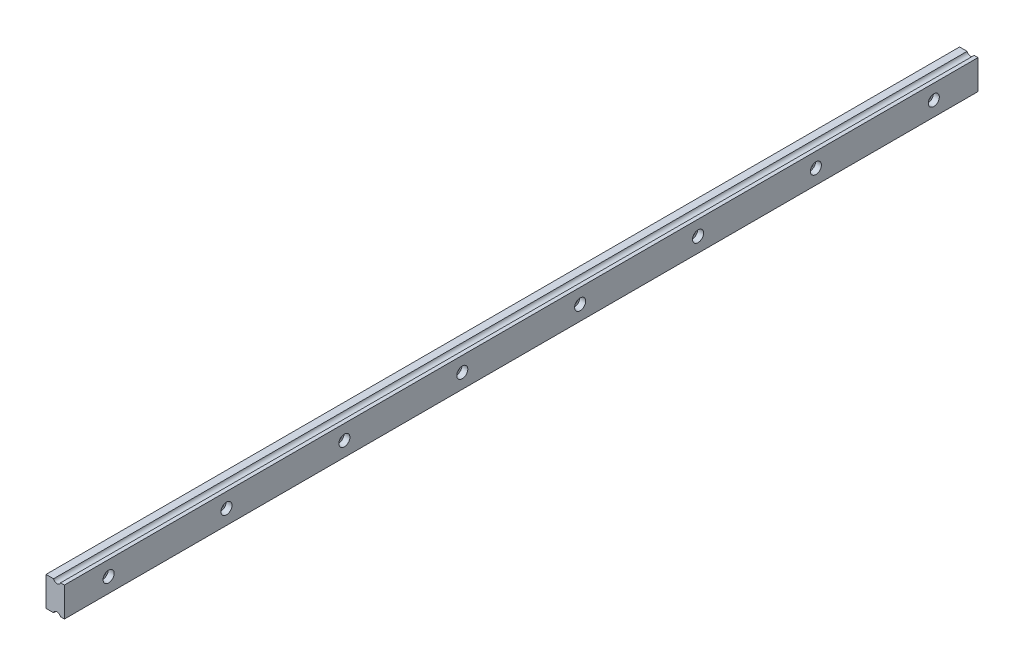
ISO-10303-21;
HEADER;
FILE_DESCRIPTION(('STEP AP214'),'2;1');
FILE_NAME('part.step','',(''),(''),'','','');
FILE_SCHEMA(('AUTOMOTIVE_DESIGN { 1 0 10303 214 1 1 1 1 }'));
ENDSEC;
DATA;
#1=APPLICATION_CONTEXT('core data for automotive mechanical design processes');
#2=APPLICATION_PROTOCOL_DEFINITION('international standard','automotive_design',2000,#1);
#3=PRODUCT_CONTEXT('',#1,'mechanical');
#4=PRODUCT('Part','Part','',(#3));
#5=PRODUCT_RELATED_PRODUCT_CATEGORY('part','',(#4));
#6=PRODUCT_DEFINITION_FORMATION('','',#4);
#7=PRODUCT_DEFINITION_CONTEXT('part definition',#1,'design');
#8=PRODUCT_DEFINITION('design','',#6,#7);
#9=PRODUCT_DEFINITION_SHAPE('','',#8);
#10=(LENGTH_UNIT() NAMED_UNIT(*) SI_UNIT(.MILLI.,.METRE.));
#11=(NAMED_UNIT(*) PLANE_ANGLE_UNIT() SI_UNIT($,.RADIAN.));
#12=(NAMED_UNIT(*) SI_UNIT($,.STERADIAN.) SOLID_ANGLE_UNIT());
#13=UNCERTAINTY_MEASURE_WITH_UNIT(LENGTH_MEASURE(1.E-05),#10,'distance_accuracy_value','');
#14=(GEOMETRIC_REPRESENTATION_CONTEXT(3) GLOBAL_UNCERTAINTY_ASSIGNED_CONTEXT((#13)) GLOBAL_UNIT_ASSIGNED_CONTEXT((#10,
#11,#12)) REPRESENTATION_CONTEXT('',''));
#15=CARTESIAN_POINT('',(0.,0.,0.));
#16=DIRECTION('',(0.,0.,1.));
#17=DIRECTION('',(1.,0.,0.));
#18=AXIS2_PLACEMENT_3D('',#15,#16,#17);
#19=CARTESIAN_POINT('',(-15.,20.,620.));
#20=DIRECTION('',(1.,0.,0.));
#21=DIRECTION('',(0.,0.,-1.));
#22=AXIS2_PLACEMENT_3D('',#19,#20,#21);
#23=PLANE('',#22);
#24=CARTESIAN_POINT('',(-15.,0.,-560.));
#25=DIRECTION('',(1.,0.,0.));
#26=DIRECTION('',(0.,0.,-1.));
#27=AXIS2_PLACEMENT_3D('',#24,#25,#26);
#28=CIRCLE('',#27,4.5);
#29=CARTESIAN_POINT('',(-15.,0.,-564.5));
#30=VERTEX_POINT('',#29);
#31=EDGE_CURVE('E516',#30,#30,#28,.T.);
#32=ORIENTED_EDGE('',*,*,#31,.T.);
#33=EDGE_LOOP('',(#32));
#34=FACE_BOUND('',#33,.T.);
#35=CARTESIAN_POINT('',(-15.,0.,-400.));
#36=DIRECTION('',(1.,0.,0.));
#37=DIRECTION('',(0.,0.,-1.));
#38=AXIS2_PLACEMENT_3D('',#35,#36,#37);
#39=CIRCLE('',#38,4.5);
#40=CARTESIAN_POINT('',(-15.,0.,-404.5));
#41=VERTEX_POINT('',#40);
#42=EDGE_CURVE('E520',#41,#41,#39,.T.);
#43=ORIENTED_EDGE('',*,*,#42,.T.);
#44=EDGE_LOOP('',(#43));
#45=FACE_BOUND('',#44,.T.);
#46=CARTESIAN_POINT('',(-15.,0.,-240.));
#47=DIRECTION('',(1.,0.,0.));
#48=DIRECTION('',(0.,0.,-1.));
#49=AXIS2_PLACEMENT_3D('',#46,#47,#48);
#50=CIRCLE('',#49,4.5);
#51=CARTESIAN_POINT('',(-15.,0.,-244.5));
#52=VERTEX_POINT('',#51);
#53=EDGE_CURVE('E524',#52,#52,#50,.T.);
#54=ORIENTED_EDGE('',*,*,#53,.T.);
#55=EDGE_LOOP('',(#54));
#56=FACE_BOUND('',#55,.T.);
#57=CARTESIAN_POINT('',(-15.,0.,-79.9999999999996));
#58=DIRECTION('',(1.,0.,0.));
#59=DIRECTION('',(0.,0.,-1.));
#60=AXIS2_PLACEMENT_3D('',#57,#58,#59);
#61=CIRCLE('',#60,4.5);
#62=CARTESIAN_POINT('',(-15.,0.,-84.4999999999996));
#63=VERTEX_POINT('',#62);
#64=EDGE_CURVE('E528',#63,#63,#61,.T.);
#65=ORIENTED_EDGE('',*,*,#64,.T.);
#66=EDGE_LOOP('',(#65));
#67=FACE_BOUND('',#66,.T.);
#68=CARTESIAN_POINT('',(-15.,0.,80.0000000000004));
#69=DIRECTION('',(1.,0.,0.));
#70=DIRECTION('',(0.,0.,-1.));
#71=AXIS2_PLACEMENT_3D('',#68,#69,#70);
#72=CIRCLE('',#71,4.5);
#73=CARTESIAN_POINT('',(-15.,0.,75.5000000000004));
#74=VERTEX_POINT('',#73);
#75=EDGE_CURVE('E532',#74,#74,#72,.T.);
#76=ORIENTED_EDGE('',*,*,#75,.T.);
#77=EDGE_LOOP('',(#76));
#78=FACE_BOUND('',#77,.T.);
#79=CARTESIAN_POINT('',(-15.,0.,240.));
#80=DIRECTION('',(1.,0.,0.));
#81=DIRECTION('',(0.,0.,-1.));
#82=AXIS2_PLACEMENT_3D('',#79,#80,#81);
#83=CIRCLE('',#82,4.5);
#84=CARTESIAN_POINT('',(-15.,0.,235.5));
#85=VERTEX_POINT('',#84);
#86=EDGE_CURVE('E536',#85,#85,#83,.T.);
#87=ORIENTED_EDGE('',*,*,#86,.T.);
#88=EDGE_LOOP('',(#87));
#89=FACE_BOUND('',#88,.T.);
#90=CARTESIAN_POINT('',(-15.,0.,400.));
#91=DIRECTION('',(1.,0.,0.));
#92=DIRECTION('',(0.,0.,-1.));
#93=AXIS2_PLACEMENT_3D('',#90,#91,#92);
#94=CIRCLE('',#93,4.5);
#95=CARTESIAN_POINT('',(-15.,0.,395.5));
#96=VERTEX_POINT('',#95);
#97=EDGE_CURVE('E540',#96,#96,#94,.T.);
#98=ORIENTED_EDGE('',*,*,#97,.T.);
#99=EDGE_LOOP('',(#98));
#100=FACE_BOUND('',#99,.T.);
#101=CARTESIAN_POINT('',(-15.,0.,560.));
#102=DIRECTION('',(1.,0.,0.));
#103=DIRECTION('',(0.,0.,-1.));
#104=AXIS2_PLACEMENT_3D('',#101,#102,#103);
#105=CIRCLE('',#104,4.5);
#106=CARTESIAN_POINT('',(-15.,0.,555.5));
#107=VERTEX_POINT('',#106);
#108=EDGE_CURVE('E543',#107,#107,#105,.T.);
#109=ORIENTED_EDGE('',*,*,#108,.T.);
#110=EDGE_LOOP('',(#109));
#111=FACE_BOUND('',#110,.T.);
#112=DIRECTION('',(0.,-1.,0.));
#113=VECTOR('',#112,1.);
#114=CARTESIAN_POINT('',(-15.,20.,-620.));
#115=LINE('',#114,#113);
#116=CARTESIAN_POINT('',(-15.,20.,-620.));
#117=VERTEX_POINT('',#116);
#118=CARTESIAN_POINT('',(-15.,-20.,-620.));
#119=VERTEX_POINT('',#118);
#120=EDGE_CURVE('E416',#117,#119,#115,.T.);
#121=ORIENTED_EDGE('',*,*,#120,.T.);
#122=DIRECTION('',(0.,0.,-1.));
#123=VECTOR('',#122,1.);
#124=CARTESIAN_POINT('',(-15.,-20.,620.));
#125=LINE('',#124,#123);
#126=CARTESIAN_POINT('',(-15.,-20.,620.));
#127=VERTEX_POINT('',#126);
#128=EDGE_CURVE('E11',#127,#119,#125,.T.);
#129=ORIENTED_EDGE('',*,*,#128,.F.);
#130=DIRECTION('',(0.,-1.,0.));
#131=VECTOR('',#130,1.);
#132=CARTESIAN_POINT('',(-15.,20.,620.));
#133=LINE('',#132,#131);
#134=CARTESIAN_POINT('',(-15.,20.,620.));
#135=VERTEX_POINT('',#134);
#136=EDGE_CURVE('E448',#135,#127,#133,.T.);
#137=ORIENTED_EDGE('',*,*,#136,.F.);
#138=DIRECTION('',(0.,0.,-1.));
#139=VECTOR('',#138,1.);
#140=CARTESIAN_POINT('',(-15.,20.,620.));
#141=LINE('',#140,#139);
#142=EDGE_CURVE('E429',#135,#117,#141,.T.);
#143=ORIENTED_EDGE('',*,*,#142,.T.);
#144=EDGE_LOOP('',(#121,#129,#137,#143));
#145=FACE_BOUND('',#144,.T.);
#146=ADVANCED_FACE('F348',(#34,#45,#56,#67,#78,#89,#100,#111,#145),#23,.F.);
#147=CARTESIAN_POINT('',(-15.,-20.,620.));
#148=DIRECTION('',(0.,1.,0.));
#149=DIRECTION('',(-1.,0.,0.));
#150=AXIS2_PLACEMENT_3D('',#147,#148,#149);
#151=PLANE('',#150);
#152=DIRECTION('',(1.,0.,0.));
#153=VECTOR('',#152,1.);
#154=CARTESIAN_POINT('',(-15.,-20.,-620.));
#155=LINE('',#154,#153);
#156=CARTESIAN_POINT('',(-4.76969600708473,-20.,-620.));
#157=VERTEX_POINT('',#156);
#158=EDGE_CURVE('E412',#119,#157,#155,.T.);
#159=ORIENTED_EDGE('',*,*,#158,.T.);
#160=DIRECTION('',(0.,0.,-1.));
#161=VECTOR('',#160,1.);
#162=CARTESIAN_POINT('',(-4.76969600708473,-20.,620.));
#163=LINE('',#162,#161);
#164=CARTESIAN_POINT('',(-4.76969600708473,-20.,620.));
#165=VERTEX_POINT('',#164);
#166=EDGE_CURVE('E355',#165,#157,#163,.T.);
#167=ORIENTED_EDGE('',*,*,#166,.F.);
#168=DIRECTION('',(1.,0.,0.));
#169=VECTOR('',#168,1.);
#170=CARTESIAN_POINT('',(-15.,-20.,620.));
#171=LINE('',#170,#169);
#172=EDGE_CURVE('E425',#127,#165,#171,.T.);
#173=ORIENTED_EDGE('',*,*,#172,.F.);
#174=ORIENTED_EDGE('',*,*,#128,.T.);
#175=EDGE_LOOP('',(#159,#167,#173,#174));
#176=FACE_BOUND('',#175,.T.);
#177=ADVANCED_FACE('F424',(#176),#151,.F.);
#178=CARTESIAN_POINT('',(0.,-21.5000000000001,620.));
#179=DIRECTION('',(0.,0.,-1.));
#180=DIRECTION('',(-1.,0.,0.));
#181=AXIS2_PLACEMENT_3D('',#178,#179,#180);
#182=CYLINDRICAL_SURFACE('',#181,5.);
#183=CARTESIAN_POINT('',(0.,-21.5000000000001,-620.));
#184=DIRECTION('',(0.,0.,-1.));
#185=DIRECTION('',(1.,0.,0.));
#186=AXIS2_PLACEMENT_3D('',#183,#184,#185);
#187=CIRCLE('',#186,5.);
#188=CARTESIAN_POINT('',(4.76969600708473,-20.,-620.));
#189=VERTEX_POINT('',#188);
#190=EDGE_CURVE('E418',#157,#189,#187,.T.);
#191=ORIENTED_EDGE('',*,*,#190,.T.);
#192=DIRECTION('',(0.,0.,-1.));
#193=VECTOR('',#192,1.);
#194=CARTESIAN_POINT('',(4.76969600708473,-20.,620.));
#195=LINE('',#194,#193);
#196=CARTESIAN_POINT('',(4.76969600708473,-20.,620.));
#197=VERTEX_POINT('',#196);
#198=EDGE_CURVE('E474',#197,#189,#195,.T.);
#199=ORIENTED_EDGE('',*,*,#198,.F.);
#200=CARTESIAN_POINT('',(0.,-21.5000000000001,620.));
#201=DIRECTION('',(0.,0.,-1.));
#202=DIRECTION('',(1.,0.,0.));
#203=AXIS2_PLACEMENT_3D('',#200,#201,#202);
#204=CIRCLE('',#203,5.);
#205=EDGE_CURVE('E451',#165,#197,#204,.T.);
#206=ORIENTED_EDGE('',*,*,#205,.F.);
#207=ORIENTED_EDGE('',*,*,#166,.T.);
#208=EDGE_LOOP('',(#191,#199,#206,#207));
#209=FACE_BOUND('',#208,.T.);
#210=ADVANCED_FACE('F478',(#209),#182,.F.);
#211=CARTESIAN_POINT('',(4.76969600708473,-20.,620.));
#212=DIRECTION('',(0.,1.,0.));
#213=DIRECTION('',(0.,0.,1.));
#214=AXIS2_PLACEMENT_3D('',#211,#212,#213);
#215=PLANE('',#214);
#216=DIRECTION('',(1.,0.,0.));
#217=VECTOR('',#216,1.);
#218=CARTESIAN_POINT('',(4.76969600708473,-20.,-620.));
#219=LINE('',#218,#217);
#220=CARTESIAN_POINT('',(10.,-20.,-620.));
#221=VERTEX_POINT('',#220);
#222=EDGE_CURVE('E438',#189,#221,#219,.T.);
#223=ORIENTED_EDGE('',*,*,#222,.T.);
#224=DIRECTION('',(0.,0.,-1.));
#225=VECTOR('',#224,1.);
#226=CARTESIAN_POINT('',(10.,-20.,620.));
#227=LINE('',#226,#225);
#228=CARTESIAN_POINT('',(10.,-20.,620.));
#229=VERTEX_POINT('',#228);
#230=EDGE_CURVE('E471',#229,#221,#227,.T.);
#231=ORIENTED_EDGE('',*,*,#230,.F.);
#232=DIRECTION('',(1.,0.,0.));
#233=VECTOR('',#232,1.);
#234=CARTESIAN_POINT('',(4.76969600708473,-20.,620.));
#235=LINE('',#234,#233);
#236=EDGE_CURVE('E453',#197,#229,#235,.T.);
#237=ORIENTED_EDGE('',*,*,#236,.F.);
#238=ORIENTED_EDGE('',*,*,#198,.T.);
#239=EDGE_LOOP('',(#223,#231,#237,#238));
#240=FACE_BOUND('',#239,.T.);
#241=ADVANCED_FACE('F486',(#240),#215,.F.);
#242=CARTESIAN_POINT('',(10.,20.,620.));
#243=DIRECTION('',(-1.,0.,0.));
#244=DIRECTION('',(0.,0.,1.));
#245=AXIS2_PLACEMENT_3D('',#242,#243,#244);
#246=PLANE('',#245);
#247=CARTESIAN_POINT('',(10.,0.,-560.));
#248=DIRECTION('',(1.,0.,0.));
#249=DIRECTION('',(0.,0.,-1.));
#250=AXIS2_PLACEMENT_3D('',#247,#248,#249);
#251=CIRCLE('',#250,7.5);
#252=CARTESIAN_POINT('',(10.,0.,-567.5));
#253=VERTEX_POINT('',#252);
#254=EDGE_CURVE('E585',#253,#253,#251,.T.);
#255=ORIENTED_EDGE('',*,*,#254,.F.);
#256=EDGE_LOOP('',(#255));
#257=FACE_BOUND('',#256,.T.);
#258=CARTESIAN_POINT('',(10.,0.,-400.));
#259=DIRECTION('',(1.,0.,0.));
#260=DIRECTION('',(0.,0.,-1.));
#261=AXIS2_PLACEMENT_3D('',#258,#259,#260);
#262=CIRCLE('',#261,7.5);
#263=CARTESIAN_POINT('',(10.,0.,-407.5));
#264=VERTEX_POINT('',#263);
#265=EDGE_CURVE('E589',#264,#264,#262,.T.);
#266=ORIENTED_EDGE('',*,*,#265,.F.);
#267=EDGE_LOOP('',(#266));
#268=FACE_BOUND('',#267,.T.);
#269=CARTESIAN_POINT('',(10.,0.,-240.));
#270=DIRECTION('',(1.,0.,0.));
#271=DIRECTION('',(0.,0.,-1.));
#272=AXIS2_PLACEMENT_3D('',#269,#270,#271);
#273=CIRCLE('',#272,7.5);
#274=CARTESIAN_POINT('',(10.,0.,-247.5));
#275=VERTEX_POINT('',#274);
#276=EDGE_CURVE('E593',#275,#275,#273,.T.);
#277=ORIENTED_EDGE('',*,*,#276,.F.);
#278=EDGE_LOOP('',(#277));
#279=FACE_BOUND('',#278,.T.);
#280=CARTESIAN_POINT('',(10.,0.,-79.9999999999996));
#281=DIRECTION('',(1.,0.,0.));
#282=DIRECTION('',(0.,0.,-1.));
#283=AXIS2_PLACEMENT_3D('',#280,#281,#282);
#284=CIRCLE('',#283,7.5);
#285=CARTESIAN_POINT('',(10.,0.,-87.4999999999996));
#286=VERTEX_POINT('',#285);
#287=EDGE_CURVE('E597',#286,#286,#284,.T.);
#288=ORIENTED_EDGE('',*,*,#287,.F.);
#289=EDGE_LOOP('',(#288));
#290=FACE_BOUND('',#289,.T.);
#291=CARTESIAN_POINT('',(10.,0.,80.0000000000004));
#292=DIRECTION('',(1.,0.,0.));
#293=DIRECTION('',(0.,0.,-1.));
#294=AXIS2_PLACEMENT_3D('',#291,#292,#293);
#295=CIRCLE('',#294,7.5);
#296=CARTESIAN_POINT('',(10.,0.,72.5000000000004));
#297=VERTEX_POINT('',#296);
#298=EDGE_CURVE('E601',#297,#297,#295,.T.);
#299=ORIENTED_EDGE('',*,*,#298,.F.);
#300=EDGE_LOOP('',(#299));
#301=FACE_BOUND('',#300,.T.);
#302=CARTESIAN_POINT('',(10.,0.,240.));
#303=DIRECTION('',(1.,0.,0.));
#304=DIRECTION('',(0.,0.,-1.));
#305=AXIS2_PLACEMENT_3D('',#302,#303,#304);
#306=CIRCLE('',#305,7.5);
#307=CARTESIAN_POINT('',(10.,0.,232.5));
#308=VERTEX_POINT('',#307);
#309=EDGE_CURVE('E605',#308,#308,#306,.T.);
#310=ORIENTED_EDGE('',*,*,#309,.F.);
#311=EDGE_LOOP('',(#310));
#312=FACE_BOUND('',#311,.T.);
#313=CARTESIAN_POINT('',(10.,0.,400.));
#314=DIRECTION('',(1.,0.,0.));
#315=DIRECTION('',(0.,0.,-1.));
#316=AXIS2_PLACEMENT_3D('',#313,#314,#315);
#317=CIRCLE('',#316,7.5);
#318=CARTESIAN_POINT('',(10.,0.,392.5));
#319=VERTEX_POINT('',#318);
#320=EDGE_CURVE('E546',#319,#319,#317,.T.);
#321=ORIENTED_EDGE('',*,*,#320,.F.);
#322=EDGE_LOOP('',(#321));
#323=FACE_BOUND('',#322,.T.);
#324=CARTESIAN_POINT('',(10.,0.,560.));
#325=DIRECTION('',(1.,0.,0.));
#326=DIRECTION('',(0.,0.,-1.));
#327=AXIS2_PLACEMENT_3D('',#324,#325,#326);
#328=CIRCLE('',#327,7.5);
#329=CARTESIAN_POINT('',(10.,0.,552.5));
#330=VERTEX_POINT('',#329);
#331=EDGE_CURVE('E430',#330,#330,#328,.T.);
#332=ORIENTED_EDGE('',*,*,#331,.F.);
#333=EDGE_LOOP('',(#332));
#334=FACE_BOUND('',#333,.T.);
#335=DIRECTION('',(0.,1.,0.));
#336=VECTOR('',#335,1.);
#337=CARTESIAN_POINT('',(10.,20.,-620.));
#338=LINE('',#337,#336);
#339=CARTESIAN_POINT('',(10.,20.,-620.));
#340=VERTEX_POINT('',#339);
#341=EDGE_CURVE('E440',#221,#340,#338,.T.);
#342=ORIENTED_EDGE('',*,*,#341,.T.);
#343=DIRECTION('',(0.,0.,-1.));
#344=VECTOR('',#343,1.);
#345=CARTESIAN_POINT('',(10.,20.,620.));
#346=LINE('',#345,#344);
#347=CARTESIAN_POINT('',(10.,20.,620.));
#348=VERTEX_POINT('',#347);
#349=EDGE_CURVE('E468',#348,#340,#346,.T.);
#350=ORIENTED_EDGE('',*,*,#349,.F.);
#351=DIRECTION('',(0.,1.,0.));
#352=VECTOR('',#351,1.);
#353=CARTESIAN_POINT('',(10.,20.,620.));
#354=LINE('',#353,#352);
#355=EDGE_CURVE('E455',#229,#348,#354,.T.);
#356=ORIENTED_EDGE('',*,*,#355,.F.);
#357=ORIENTED_EDGE('',*,*,#230,.T.);
#358=EDGE_LOOP('',(#342,#350,#356,#357));
#359=FACE_BOUND('',#358,.T.);
#360=ADVANCED_FACE('F489',(#257,#268,#279,#290,#301,#312,#323,#334,#359),#246,.F.);
#361=CARTESIAN_POINT('',(4.76969600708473,20.,620.));
#362=DIRECTION('',(0.,-1.,0.));
#363=DIRECTION('',(0.,0.,-1.));
#364=AXIS2_PLACEMENT_3D('',#361,#362,#363);
#365=PLANE('',#364);
#366=DIRECTION('',(-1.,0.,0.));
#367=VECTOR('',#366,1.);
#368=CARTESIAN_POINT('',(4.76969600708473,20.,-620.));
#369=LINE('',#368,#367);
#370=CARTESIAN_POINT('',(4.76969600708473,20.,-620.));
#371=VERTEX_POINT('',#370);
#372=EDGE_CURVE('E442',#340,#371,#369,.T.);
#373=ORIENTED_EDGE('',*,*,#372,.T.);
#374=DIRECTION('',(0.,0.,-1.));
#375=VECTOR('',#374,1.);
#376=CARTESIAN_POINT('',(4.76969600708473,20.,620.));
#377=LINE('',#376,#375);
#378=CARTESIAN_POINT('',(4.76969600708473,20.,620.));
#379=VERTEX_POINT('',#378);
#380=EDGE_CURVE('E465',#379,#371,#377,.T.);
#381=ORIENTED_EDGE('',*,*,#380,.F.);
#382=DIRECTION('',(-1.,0.,0.));
#383=VECTOR('',#382,1.);
#384=CARTESIAN_POINT('',(4.76969600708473,20.,620.));
#385=LINE('',#384,#383);
#386=EDGE_CURVE('E457',#348,#379,#385,.T.);
#387=ORIENTED_EDGE('',*,*,#386,.F.);
#388=ORIENTED_EDGE('',*,*,#349,.T.);
#389=EDGE_LOOP('',(#373,#381,#387,#388));
#390=FACE_BOUND('',#389,.T.);
#391=ADVANCED_FACE('F494',(#390),#365,.F.);
#392=CARTESIAN_POINT('',(0.,21.5000000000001,620.));
#393=DIRECTION('',(0.,0.,-1.));
#394=DIRECTION('',(-1.,0.,0.));
#395=AXIS2_PLACEMENT_3D('',#392,#393,#394);
#396=CYLINDRICAL_SURFACE('',#395,5.);
#397=CARTESIAN_POINT('',(0.,21.5000000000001,-620.));
#398=DIRECTION('',(0.,0.,-1.));
#399=DIRECTION('',(1.,0.,0.));
#400=AXIS2_PLACEMENT_3D('',#397,#398,#399);
#401=CIRCLE('',#400,5.);
#402=CARTESIAN_POINT('',(-4.76969600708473,20.,-620.));
#403=VERTEX_POINT('',#402);
#404=EDGE_CURVE('E444',#371,#403,#401,.T.);
#405=ORIENTED_EDGE('',*,*,#404,.T.);
#406=DIRECTION('',(0.,0.,-1.));
#407=VECTOR('',#406,1.);
#408=CARTESIAN_POINT('',(-4.76969600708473,20.,620.));
#409=LINE('',#408,#407);
#410=CARTESIAN_POINT('',(-4.76969600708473,20.,620.));
#411=VERTEX_POINT('',#410);
#412=EDGE_CURVE('E462',#411,#403,#409,.T.);
#413=ORIENTED_EDGE('',*,*,#412,.F.);
#414=CARTESIAN_POINT('',(0.,21.5000000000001,620.));
#415=DIRECTION('',(0.,0.,-1.));
#416=DIRECTION('',(1.,0.,0.));
#417=AXIS2_PLACEMENT_3D('',#414,#415,#416);
#418=CIRCLE('',#417,5.);
#419=EDGE_CURVE('E367',#379,#411,#418,.T.);
#420=ORIENTED_EDGE('',*,*,#419,.F.);
#421=ORIENTED_EDGE('',*,*,#380,.T.);
#422=EDGE_LOOP('',(#405,#413,#420,#421));
#423=FACE_BOUND('',#422,.T.);
#424=ADVANCED_FACE('F497',(#423),#396,.F.);
#425=CARTESIAN_POINT('',(-15.,20.,620.));
#426=DIRECTION('',(0.,-1.,0.));
#427=DIRECTION('',(1.,0.,0.));
#428=AXIS2_PLACEMENT_3D('',#425,#426,#427);
#429=PLANE('',#428);
#430=DIRECTION('',(-1.,0.,0.));
#431=VECTOR('',#430,1.);
#432=CARTESIAN_POINT('',(-15.,20.,-620.));
#433=LINE('',#432,#431);
#434=EDGE_CURVE('E446',#403,#117,#433,.T.);
#435=ORIENTED_EDGE('',*,*,#434,.T.);
#436=ORIENTED_EDGE('',*,*,#142,.F.);
#437=DIRECTION('',(-1.,0.,0.));
#438=VECTOR('',#437,1.);
#439=CARTESIAN_POINT('',(-15.,20.,620.));
#440=LINE('',#439,#438);
#441=EDGE_CURVE('E362',#411,#135,#440,.T.);
#442=ORIENTED_EDGE('',*,*,#441,.F.);
#443=ORIENTED_EDGE('',*,*,#412,.T.);
#444=EDGE_LOOP('',(#435,#436,#442,#443));
#445=FACE_BOUND('',#444,.T.);
#446=ADVANCED_FACE('F499',(#445),#429,.F.);
#447=CARTESIAN_POINT('',(0.,-21.5000000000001,620.));
#448=DIRECTION('',(0.,0.,1.));
#449=DIRECTION('',(1.,0.,0.));
#450=AXIS2_PLACEMENT_3D('',#447,#448,#449);
#451=PLANE('',#450);
#452=ORIENTED_EDGE('',*,*,#136,.T.);
#453=ORIENTED_EDGE('',*,*,#172,.T.);
#454=ORIENTED_EDGE('',*,*,#205,.T.);
#455=ORIENTED_EDGE('',*,*,#236,.T.);
#456=ORIENTED_EDGE('',*,*,#355,.T.);
#457=ORIENTED_EDGE('',*,*,#386,.T.);
#458=ORIENTED_EDGE('',*,*,#419,.T.);
#459=ORIENTED_EDGE('',*,*,#441,.T.);
#460=EDGE_LOOP('',(#452,#453,#454,#455,#456,#457,#458,#459));
#461=FACE_BOUND('',#460,.T.);
#462=ADVANCED_FACE('F481',(#461),#451,.T.);
#463=CARTESIAN_POINT('',(0.,-21.5000000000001,-620.));
#464=DIRECTION('',(0.,0.,1.));
#465=DIRECTION('',(1.,0.,0.));
#466=AXIS2_PLACEMENT_3D('',#463,#464,#465);
#467=PLANE('',#466);
#468=ORIENTED_EDGE('',*,*,#120,.F.);
#469=ORIENTED_EDGE('',*,*,#434,.F.);
#470=ORIENTED_EDGE('',*,*,#404,.F.);
#471=ORIENTED_EDGE('',*,*,#372,.F.);
#472=ORIENTED_EDGE('',*,*,#341,.F.);
#473=ORIENTED_EDGE('',*,*,#222,.F.);
#474=ORIENTED_EDGE('',*,*,#190,.F.);
#475=ORIENTED_EDGE('',*,*,#158,.F.);
#476=EDGE_LOOP('',(#468,#469,#470,#471,#472,#473,#474,#475));
#477=FACE_BOUND('',#476,.T.);
#478=ADVANCED_FACE('F413',(#477),#467,.F.);
#479=CARTESIAN_POINT('',(10.,0.,560.));
#480=DIRECTION('',(1.,0.,0.));
#481=DIRECTION('',(0.,0.,-1.));
#482=AXIS2_PLACEMENT_3D('',#479,#480,#481);
#483=CYLINDRICAL_SURFACE('',#482,7.5);
#484=CARTESIAN_POINT('',(2.,0.,560.));
#485=DIRECTION('',(1.,0.,0.));
#486=DIRECTION('',(0.,0.,-1.));
#487=AXIS2_PLACEMENT_3D('',#484,#485,#486);
#488=CIRCLE('',#487,7.5);
#489=CARTESIAN_POINT('',(2.,0.,552.5));
#490=VERTEX_POINT('',#489);
#491=EDGE_CURVE('E433',#490,#490,#488,.T.);
#492=ORIENTED_EDGE('',*,*,#491,.F.);
#493=EDGE_LOOP('',(#492));
#494=FACE_BOUND('',#493,.T.);
#495=ORIENTED_EDGE('',*,*,#331,.T.);
#496=EDGE_LOOP('',(#495));
#497=FACE_BOUND('',#496,.T.);
#498=ADVANCED_FACE('F559',(#494,#497),#483,.F.);
#499=CARTESIAN_POINT('',(2.,4.49999999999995,560.));
#500=DIRECTION('',(-1.,0.,0.));
#501=DIRECTION('',(0.,0.,1.));
#502=AXIS2_PLACEMENT_3D('',#499,#500,#501);
#503=PLANE('',#502);
#504=CARTESIAN_POINT('',(2.,0.,560.));
#505=DIRECTION('',(1.,0.,0.));
#506=DIRECTION('',(0.,0.,-1.));
#507=AXIS2_PLACEMENT_3D('',#504,#505,#506);
#508=CIRCLE('',#507,4.50000000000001);
#509=CARTESIAN_POINT('',(2.,0.,555.5));
#510=VERTEX_POINT('',#509);
#511=EDGE_CURVE('E545',#510,#510,#508,.T.);
#512=ORIENTED_EDGE('',*,*,#511,.F.);
#513=EDGE_LOOP('',(#512));
#514=FACE_BOUND('',#513,.T.);
#515=ORIENTED_EDGE('',*,*,#491,.T.);
#516=EDGE_LOOP('',(#515));
#517=FACE_BOUND('',#516,.T.);
#518=ADVANCED_FACE('F557',(#514,#517),#503,.F.);
#519=CARTESIAN_POINT('',(10.,0.,560.));
#520=DIRECTION('',(1.,0.,0.));
#521=DIRECTION('',(0.,0.,-1.));
#522=AXIS2_PLACEMENT_3D('',#519,#520,#521);
#523=CYLINDRICAL_SURFACE('',#522,4.5);
#524=ORIENTED_EDGE('',*,*,#108,.F.);
#525=EDGE_LOOP('',(#524));
#526=FACE_BOUND('',#525,.T.);
#527=ORIENTED_EDGE('',*,*,#511,.T.);
#528=EDGE_LOOP('',(#527));
#529=FACE_BOUND('',#528,.T.);
#530=ADVANCED_FACE('F611',(#526,#529),#523,.F.);
#531=CARTESIAN_POINT('',(10.,0.,400.));
#532=DIRECTION('',(1.,0.,0.));
#533=DIRECTION('',(0.,0.,-1.));
#534=AXIS2_PLACEMENT_3D('',#531,#532,#533);
#535=CYLINDRICAL_SURFACE('',#534,7.5);
#536=CARTESIAN_POINT('',(2.,0.,400.));
#537=DIRECTION('',(1.,0.,0.));
#538=DIRECTION('',(0.,0.,-1.));
#539=AXIS2_PLACEMENT_3D('',#536,#537,#538);
#540=CIRCLE('',#539,7.5);
#541=CARTESIAN_POINT('',(2.,0.,392.5));
#542=VERTEX_POINT('',#541);
#543=EDGE_CURVE('E551',#542,#542,#540,.T.);
#544=ORIENTED_EDGE('',*,*,#543,.F.);
#545=EDGE_LOOP('',(#544));
#546=FACE_BOUND('',#545,.T.);
#547=ORIENTED_EDGE('',*,*,#320,.T.);
#548=EDGE_LOOP('',(#547));
#549=FACE_BOUND('',#548,.T.);
#550=ADVANCED_FACE('F608',(#546,#549),#535,.F.);
#551=CARTESIAN_POINT('',(2.,4.49999999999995,400.));
#552=DIRECTION('',(-1.,0.,0.));
#553=DIRECTION('',(0.,0.,1.));
#554=AXIS2_PLACEMENT_3D('',#551,#552,#553);
#555=PLANE('',#554);
#556=CARTESIAN_POINT('',(2.,0.,400.));
#557=DIRECTION('',(1.,0.,0.));
#558=DIRECTION('',(0.,0.,-1.));
#559=AXIS2_PLACEMENT_3D('',#556,#557,#558);
#560=CIRCLE('',#559,4.50000000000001);
#561=CARTESIAN_POINT('',(2.,0.,395.5));
#562=VERTEX_POINT('',#561);
#563=EDGE_CURVE('E769',#562,#562,#560,.T.);
#564=ORIENTED_EDGE('',*,*,#563,.F.);
#565=EDGE_LOOP('',(#564));
#566=FACE_BOUND('',#565,.T.);
#567=ORIENTED_EDGE('',*,*,#543,.T.);
#568=EDGE_LOOP('',(#567));
#569=FACE_BOUND('',#568,.T.);
#570=ADVANCED_FACE('F610',(#566,#569),#555,.F.);
#571=CARTESIAN_POINT('',(10.,0.,400.));
#572=DIRECTION('',(1.,0.,0.));
#573=DIRECTION('',(0.,0.,-1.));
#574=AXIS2_PLACEMENT_3D('',#571,#572,#573);
#575=CYLINDRICAL_SURFACE('',#574,4.5);
#576=ORIENTED_EDGE('',*,*,#97,.F.);
#577=EDGE_LOOP('',(#576));
#578=FACE_BOUND('',#577,.T.);
#579=ORIENTED_EDGE('',*,*,#563,.T.);
#580=EDGE_LOOP('',(#579));
#581=FACE_BOUND('',#580,.T.);
#582=ADVANCED_FACE('F618',(#578,#581),#575,.F.);
#583=CARTESIAN_POINT('',(10.,0.,240.));
#584=DIRECTION('',(1.,0.,0.));
#585=DIRECTION('',(0.,0.,-1.));
#586=AXIS2_PLACEMENT_3D('',#583,#584,#585);
#587=CYLINDRICAL_SURFACE('',#586,7.5);
#588=CARTESIAN_POINT('',(2.,0.,240.));
#589=DIRECTION('',(1.,0.,0.));
#590=DIRECTION('',(0.,0.,-1.));
#591=AXIS2_PLACEMENT_3D('',#588,#589,#590);
#592=CIRCLE('',#591,7.5);
#593=CARTESIAN_POINT('',(2.,0.,232.5));
#594=VERTEX_POINT('',#593);
#595=EDGE_CURVE('E764',#594,#594,#592,.T.);
#596=ORIENTED_EDGE('',*,*,#595,.F.);
#597=EDGE_LOOP('',(#596));
#598=FACE_BOUND('',#597,.T.);
#599=ORIENTED_EDGE('',*,*,#309,.T.);
#600=EDGE_LOOP('',(#599));
#601=FACE_BOUND('',#600,.T.);
#602=ADVANCED_FACE('F643',(#598,#601),#587,.F.);
#603=CARTESIAN_POINT('',(2.,4.49999999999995,240.));
#604=DIRECTION('',(-1.,0.,0.));
#605=DIRECTION('',(0.,0.,1.));
#606=AXIS2_PLACEMENT_3D('',#603,#604,#605);
#607=PLANE('',#606);
#608=CARTESIAN_POINT('',(2.,0.,240.));
#609=DIRECTION('',(1.,0.,0.));
#610=DIRECTION('',(0.,0.,-1.));
#611=AXIS2_PLACEMENT_3D('',#608,#609,#610);
#612=CIRCLE('',#611,4.50000000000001);
#613=CARTESIAN_POINT('',(2.,0.,235.5));
#614=VERTEX_POINT('',#613);
#615=EDGE_CURVE('E761',#614,#614,#612,.T.);
#616=ORIENTED_EDGE('',*,*,#615,.F.);
#617=EDGE_LOOP('',(#616));
#618=FACE_BOUND('',#617,.T.);
#619=ORIENTED_EDGE('',*,*,#595,.T.);
#620=EDGE_LOOP('',(#619));
#621=FACE_BOUND('',#620,.T.);
#622=ADVANCED_FACE('F647',(#618,#621),#607,.F.);
#623=CARTESIAN_POINT('',(10.,0.,240.));
#624=DIRECTION('',(1.,0.,0.));
#625=DIRECTION('',(0.,0.,-1.));
#626=AXIS2_PLACEMENT_3D('',#623,#624,#625);
#627=CYLINDRICAL_SURFACE('',#626,4.5);
#628=ORIENTED_EDGE('',*,*,#86,.F.);
#629=EDGE_LOOP('',(#628));
#630=FACE_BOUND('',#629,.T.);
#631=ORIENTED_EDGE('',*,*,#615,.T.);
#632=EDGE_LOOP('',(#631));
#633=FACE_BOUND('',#632,.T.);
#634=ADVANCED_FACE('F651',(#630,#633),#627,.F.);
#635=CARTESIAN_POINT('',(10.,0.,80.0000000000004));
#636=DIRECTION('',(1.,0.,0.));
#637=DIRECTION('',(0.,0.,-1.));
#638=AXIS2_PLACEMENT_3D('',#635,#636,#637);
#639=CYLINDRICAL_SURFACE('',#638,7.5);
#640=CARTESIAN_POINT('',(2.,0.,80.0000000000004));
#641=DIRECTION('',(1.,0.,0.));
#642=DIRECTION('',(0.,0.,-1.));
#643=AXIS2_PLACEMENT_3D('',#640,#641,#642);
#644=CIRCLE('',#643,7.5);
#645=CARTESIAN_POINT('',(2.,0.,72.5000000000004));
#646=VERTEX_POINT('',#645);
#647=EDGE_CURVE('E756',#646,#646,#644,.T.);
#648=ORIENTED_EDGE('',*,*,#647,.F.);
#649=EDGE_LOOP('',(#648));
#650=FACE_BOUND('',#649,.T.);
#651=ORIENTED_EDGE('',*,*,#298,.T.);
#652=EDGE_LOOP('',(#651));
#653=FACE_BOUND('',#652,.T.);
#654=ADVANCED_FACE('F655',(#650,#653),#639,.F.);
#655=CARTESIAN_POINT('',(2.,4.49999999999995,80.0000000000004));
#656=DIRECTION('',(-1.,0.,0.));
#657=DIRECTION('',(0.,0.,1.));
#658=AXIS2_PLACEMENT_3D('',#655,#656,#657);
#659=PLANE('',#658);
#660=CARTESIAN_POINT('',(2.,0.,80.0000000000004));
#661=DIRECTION('',(1.,0.,0.));
#662=DIRECTION('',(0.,0.,-1.));
#663=AXIS2_PLACEMENT_3D('',#660,#661,#662);
#664=CIRCLE('',#663,4.50000000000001);
#665=CARTESIAN_POINT('',(2.,0.,75.5000000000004));
#666=VERTEX_POINT('',#665);
#667=EDGE_CURVE('E753',#666,#666,#664,.T.);
#668=ORIENTED_EDGE('',*,*,#667,.F.);
#669=EDGE_LOOP('',(#668));
#670=FACE_BOUND('',#669,.T.);
#671=ORIENTED_EDGE('',*,*,#647,.T.);
#672=EDGE_LOOP('',(#671));
#673=FACE_BOUND('',#672,.T.);
#674=ADVANCED_FACE('F659',(#670,#673),#659,.F.);
#675=CARTESIAN_POINT('',(10.,0.,80.0000000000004));
#676=DIRECTION('',(1.,0.,0.));
#677=DIRECTION('',(0.,0.,-1.));
#678=AXIS2_PLACEMENT_3D('',#675,#676,#677);
#679=CYLINDRICAL_SURFACE('',#678,4.5);
#680=ORIENTED_EDGE('',*,*,#75,.F.);
#681=EDGE_LOOP('',(#680));
#682=FACE_BOUND('',#681,.T.);
#683=ORIENTED_EDGE('',*,*,#667,.T.);
#684=EDGE_LOOP('',(#683));
#685=FACE_BOUND('',#684,.T.);
#686=ADVANCED_FACE('F663',(#682,#685),#679,.F.);
#687=CARTESIAN_POINT('',(10.,0.,-79.9999999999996));
#688=DIRECTION('',(1.,0.,0.));
#689=DIRECTION('',(0.,0.,-1.));
#690=AXIS2_PLACEMENT_3D('',#687,#688,#689);
#691=CYLINDRICAL_SURFACE('',#690,7.5);
#692=CARTESIAN_POINT('',(2.,0.,-79.9999999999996));
#693=DIRECTION('',(1.,0.,0.));
#694=DIRECTION('',(0.,0.,-1.));
#695=AXIS2_PLACEMENT_3D('',#692,#693,#694);
#696=CIRCLE('',#695,7.5);
#697=CARTESIAN_POINT('',(2.,0.,-87.4999999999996));
#698=VERTEX_POINT('',#697);
#699=EDGE_CURVE('E748',#698,#698,#696,.T.);
#700=ORIENTED_EDGE('',*,*,#699,.F.);
#701=EDGE_LOOP('',(#700));
#702=FACE_BOUND('',#701,.T.);
#703=ORIENTED_EDGE('',*,*,#287,.T.);
#704=EDGE_LOOP('',(#703));
#705=FACE_BOUND('',#704,.T.);
#706=ADVANCED_FACE('F667',(#702,#705),#691,.F.);
#707=CARTESIAN_POINT('',(2.,4.49999999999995,-79.9999999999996));
#708=DIRECTION('',(-1.,0.,0.));
#709=DIRECTION('',(0.,0.,1.));
#710=AXIS2_PLACEMENT_3D('',#707,#708,#709);
#711=PLANE('',#710);
#712=CARTESIAN_POINT('',(2.,0.,-79.9999999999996));
#713=DIRECTION('',(1.,0.,0.));
#714=DIRECTION('',(0.,0.,-1.));
#715=AXIS2_PLACEMENT_3D('',#712,#713,#714);
#716=CIRCLE('',#715,4.50000000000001);
#717=CARTESIAN_POINT('',(2.,0.,-84.4999999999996));
#718=VERTEX_POINT('',#717);
#719=EDGE_CURVE('E745',#718,#718,#716,.T.);
#720=ORIENTED_EDGE('',*,*,#719,.F.);
#721=EDGE_LOOP('',(#720));
#722=FACE_BOUND('',#721,.T.);
#723=ORIENTED_EDGE('',*,*,#699,.T.);
#724=EDGE_LOOP('',(#723));
#725=FACE_BOUND('',#724,.T.);
#726=ADVANCED_FACE('F671',(#722,#725),#711,.F.);
#727=CARTESIAN_POINT('',(10.,0.,-79.9999999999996));
#728=DIRECTION('',(1.,0.,0.));
#729=DIRECTION('',(0.,0.,-1.));
#730=AXIS2_PLACEMENT_3D('',#727,#728,#729);
#731=CYLINDRICAL_SURFACE('',#730,4.5);
#732=ORIENTED_EDGE('',*,*,#64,.F.);
#733=EDGE_LOOP('',(#732));
#734=FACE_BOUND('',#733,.T.);
#735=ORIENTED_EDGE('',*,*,#719,.T.);
#736=EDGE_LOOP('',(#735));
#737=FACE_BOUND('',#736,.T.);
#738=ADVANCED_FACE('F675',(#734,#737),#731,.F.);
#739=CARTESIAN_POINT('',(10.,0.,-240.));
#740=DIRECTION('',(1.,0.,0.));
#741=DIRECTION('',(0.,0.,-1.));
#742=AXIS2_PLACEMENT_3D('',#739,#740,#741);
#743=CYLINDRICAL_SURFACE('',#742,7.5);
#744=CARTESIAN_POINT('',(2.,0.,-240.));
#745=DIRECTION('',(1.,0.,0.));
#746=DIRECTION('',(0.,0.,-1.));
#747=AXIS2_PLACEMENT_3D('',#744,#745,#746);
#748=CIRCLE('',#747,7.5);
#749=CARTESIAN_POINT('',(2.,0.,-247.5));
#750=VERTEX_POINT('',#749);
#751=EDGE_CURVE('E740',#750,#750,#748,.T.);
#752=ORIENTED_EDGE('',*,*,#751,.F.);
#753=EDGE_LOOP('',(#752));
#754=FACE_BOUND('',#753,.T.);
#755=ORIENTED_EDGE('',*,*,#276,.T.);
#756=EDGE_LOOP('',(#755));
#757=FACE_BOUND('',#756,.T.);
#758=ADVANCED_FACE('F679',(#754,#757),#743,.F.);
#759=CARTESIAN_POINT('',(2.,4.49999999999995,-240.));
#760=DIRECTION('',(-1.,0.,0.));
#761=DIRECTION('',(0.,0.,1.));
#762=AXIS2_PLACEMENT_3D('',#759,#760,#761);
#763=PLANE('',#762);
#764=CARTESIAN_POINT('',(2.,0.,-240.));
#765=DIRECTION('',(1.,0.,0.));
#766=DIRECTION('',(0.,0.,-1.));
#767=AXIS2_PLACEMENT_3D('',#764,#765,#766);
#768=CIRCLE('',#767,4.50000000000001);
#769=CARTESIAN_POINT('',(2.,0.,-244.5));
#770=VERTEX_POINT('',#769);
#771=EDGE_CURVE('E737',#770,#770,#768,.T.);
#772=ORIENTED_EDGE('',*,*,#771,.F.);
#773=EDGE_LOOP('',(#772));
#774=FACE_BOUND('',#773,.T.);
#775=ORIENTED_EDGE('',*,*,#751,.T.);
#776=EDGE_LOOP('',(#775));
#777=FACE_BOUND('',#776,.T.);
#778=ADVANCED_FACE('F683',(#774,#777),#763,.F.);
#779=CARTESIAN_POINT('',(10.,0.,-240.));
#780=DIRECTION('',(1.,0.,0.));
#781=DIRECTION('',(0.,0.,-1.));
#782=AXIS2_PLACEMENT_3D('',#779,#780,#781);
#783=CYLINDRICAL_SURFACE('',#782,4.5);
#784=ORIENTED_EDGE('',*,*,#53,.F.);
#785=EDGE_LOOP('',(#784));
#786=FACE_BOUND('',#785,.T.);
#787=ORIENTED_EDGE('',*,*,#771,.T.);
#788=EDGE_LOOP('',(#787));
#789=FACE_BOUND('',#788,.T.);
#790=ADVANCED_FACE('F687',(#786,#789),#783,.F.);
#791=CARTESIAN_POINT('',(10.,0.,-400.));
#792=DIRECTION('',(1.,0.,0.));
#793=DIRECTION('',(0.,0.,-1.));
#794=AXIS2_PLACEMENT_3D('',#791,#792,#793);
#795=CYLINDRICAL_SURFACE('',#794,7.5);
#796=CARTESIAN_POINT('',(2.,0.,-400.));
#797=DIRECTION('',(1.,0.,0.));
#798=DIRECTION('',(0.,0.,-1.));
#799=AXIS2_PLACEMENT_3D('',#796,#797,#798);
#800=CIRCLE('',#799,7.5);
#801=CARTESIAN_POINT('',(2.,0.,-407.5));
#802=VERTEX_POINT('',#801);
#803=EDGE_CURVE('E732',#802,#802,#800,.T.);
#804=ORIENTED_EDGE('',*,*,#803,.F.);
#805=EDGE_LOOP('',(#804));
#806=FACE_BOUND('',#805,.T.);
#807=ORIENTED_EDGE('',*,*,#265,.T.);
#808=EDGE_LOOP('',(#807));
#809=FACE_BOUND('',#808,.T.);
#810=ADVANCED_FACE('F691',(#806,#809),#795,.F.);
#811=CARTESIAN_POINT('',(2.,4.49999999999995,-400.));
#812=DIRECTION('',(-1.,0.,0.));
#813=DIRECTION('',(0.,0.,1.));
#814=AXIS2_PLACEMENT_3D('',#811,#812,#813);
#815=PLANE('',#814);
#816=CARTESIAN_POINT('',(2.,0.,-400.));
#817=DIRECTION('',(1.,0.,0.));
#818=DIRECTION('',(0.,0.,-1.));
#819=AXIS2_PLACEMENT_3D('',#816,#817,#818);
#820=CIRCLE('',#819,4.50000000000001);
#821=CARTESIAN_POINT('',(2.,0.,-404.5));
#822=VERTEX_POINT('',#821);
#823=EDGE_CURVE('E729',#822,#822,#820,.T.);
#824=ORIENTED_EDGE('',*,*,#823,.F.);
#825=EDGE_LOOP('',(#824));
#826=FACE_BOUND('',#825,.T.);
#827=ORIENTED_EDGE('',*,*,#803,.T.);
#828=EDGE_LOOP('',(#827));
#829=FACE_BOUND('',#828,.T.);
#830=ADVANCED_FACE('F695',(#826,#829),#815,.F.);
#831=CARTESIAN_POINT('',(10.,0.,-400.));
#832=DIRECTION('',(1.,0.,0.));
#833=DIRECTION('',(0.,0.,-1.));
#834=AXIS2_PLACEMENT_3D('',#831,#832,#833);
#835=CYLINDRICAL_SURFACE('',#834,4.5);
#836=ORIENTED_EDGE('',*,*,#42,.F.);
#837=EDGE_LOOP('',(#836));
#838=FACE_BOUND('',#837,.T.);
#839=ORIENTED_EDGE('',*,*,#823,.T.);
#840=EDGE_LOOP('',(#839));
#841=FACE_BOUND('',#840,.T.);
#842=ADVANCED_FACE('F699',(#838,#841),#835,.F.);
#843=CARTESIAN_POINT('',(10.,0.,-560.));
#844=DIRECTION('',(1.,0.,0.));
#845=DIRECTION('',(0.,0.,-1.));
#846=AXIS2_PLACEMENT_3D('',#843,#844,#845);
#847=CYLINDRICAL_SURFACE('',#846,7.5);
#848=CARTESIAN_POINT('',(2.,0.,-560.));
#849=DIRECTION('',(1.,0.,0.));
#850=DIRECTION('',(0.,0.,-1.));
#851=AXIS2_PLACEMENT_3D('',#848,#849,#850);
#852=CIRCLE('',#851,7.5);
#853=CARTESIAN_POINT('',(2.,0.,-567.5));
#854=VERTEX_POINT('',#853);
#855=EDGE_CURVE('E721',#854,#854,#852,.T.);
#856=ORIENTED_EDGE('',*,*,#855,.F.);
#857=EDGE_LOOP('',(#856));
#858=FACE_BOUND('',#857,.T.);
#859=ORIENTED_EDGE('',*,*,#254,.T.);
#860=EDGE_LOOP('',(#859));
#861=FACE_BOUND('',#860,.T.);
#862=ADVANCED_FACE('F703',(#858,#861),#847,.F.);
#863=CARTESIAN_POINT('',(2.,4.49999999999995,-560.));
#864=DIRECTION('',(-1.,0.,0.));
#865=DIRECTION('',(0.,0.,1.));
#866=AXIS2_PLACEMENT_3D('',#863,#864,#865);
#867=PLANE('',#866);
#868=CARTESIAN_POINT('',(2.,0.,-560.));
#869=DIRECTION('',(1.,0.,0.));
#870=DIRECTION('',(0.,0.,-1.));
#871=AXIS2_PLACEMENT_3D('',#868,#869,#870);
#872=CIRCLE('',#871,4.50000000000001);
#873=CARTESIAN_POINT('',(2.,0.,-564.5));
#874=VERTEX_POINT('',#873);
#875=EDGE_CURVE('E720',#874,#874,#872,.T.);
#876=ORIENTED_EDGE('',*,*,#875,.F.);
#877=EDGE_LOOP('',(#876));
#878=FACE_BOUND('',#877,.T.);
#879=ORIENTED_EDGE('',*,*,#855,.T.);
#880=EDGE_LOOP('',(#879));
#881=FACE_BOUND('',#880,.T.);
#882=ADVANCED_FACE('F707',(#878,#881),#867,.F.);
#883=CARTESIAN_POINT('',(10.,0.,-560.));
#884=DIRECTION('',(1.,0.,0.));
#885=DIRECTION('',(0.,0.,-1.));
#886=AXIS2_PLACEMENT_3D('',#883,#884,#885);
#887=CYLINDRICAL_SURFACE('',#886,4.5);
#888=ORIENTED_EDGE('',*,*,#31,.F.);
#889=EDGE_LOOP('',(#888));
#890=FACE_BOUND('',#889,.T.);
#891=ORIENTED_EDGE('',*,*,#875,.T.);
#892=EDGE_LOOP('',(#891));
#893=FACE_BOUND('',#892,.T.);
#894=ADVANCED_FACE('F711',(#890,#893),#887,.F.);
#895=CLOSED_SHELL('',(#146,#177,#210,#241,#360,#391,#424,#446,#462,#478,#498,#518,#530,#550,
#570,#582,#602,#622,#634,#654,#674,#686,#706,#726,#738,#758,#778,#790,#810,#830,#842,#862,#882,#894));
#896=MANIFOLD_SOLID_BREP('B2',#895);
#897=ADVANCED_BREP_SHAPE_REPRESENTATION('',(#18,#896),#14);
#898=SHAPE_DEFINITION_REPRESENTATION(#9,#897);
ENDSEC;
END-ISO-10303-21;
